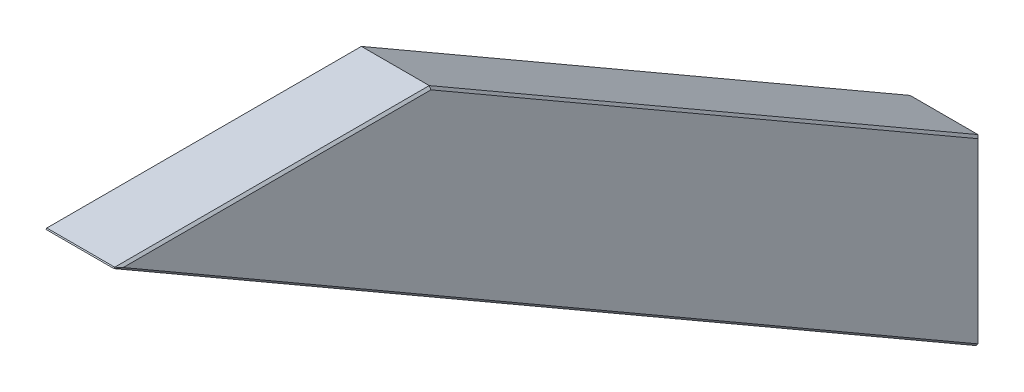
ISO-10303-21;
HEADER;
FILE_DESCRIPTION(('STEP AP214'),'2;1');
FILE_NAME('part.step','',(''),(''),'','','');
FILE_SCHEMA(('AUTOMOTIVE_DESIGN { 1 0 10303 214 1 1 1 1 }'));
ENDSEC;
DATA;
#1=APPLICATION_CONTEXT('core data for automotive mechanical design processes');
#2=APPLICATION_PROTOCOL_DEFINITION('international standard','automotive_design',2000,#1);
#3=PRODUCT_CONTEXT('',#1,'mechanical');
#4=PRODUCT('Part','Part','',(#3));
#5=PRODUCT_RELATED_PRODUCT_CATEGORY('part','',(#4));
#6=PRODUCT_DEFINITION_FORMATION('','',#4);
#7=PRODUCT_DEFINITION_CONTEXT('part definition',#1,'design');
#8=PRODUCT_DEFINITION('design','',#6,#7);
#9=PRODUCT_DEFINITION_SHAPE('','',#8);
#10=(LENGTH_UNIT() NAMED_UNIT(*) SI_UNIT(.MILLI.,.METRE.));
#11=(NAMED_UNIT(*) PLANE_ANGLE_UNIT() SI_UNIT($,.RADIAN.));
#12=(NAMED_UNIT(*) SI_UNIT($,.STERADIAN.) SOLID_ANGLE_UNIT());
#13=UNCERTAINTY_MEASURE_WITH_UNIT(LENGTH_MEASURE(1.E-05),#10,'distance_accuracy_value','');
#14=(GEOMETRIC_REPRESENTATION_CONTEXT(3) GLOBAL_UNCERTAINTY_ASSIGNED_CONTEXT((#13)) GLOBAL_UNIT_ASSIGNED_CONTEXT((#10,
#11,#12)) REPRESENTATION_CONTEXT('',''));
#15=CARTESIAN_POINT('',(0.,0.,0.));
#16=DIRECTION('',(0.,0.,1.));
#17=DIRECTION('',(1.,0.,0.));
#18=AXIS2_PLACEMENT_3D('',#15,#16,#17);
#19=CARTESIAN_POINT('',(8.,-69.9979466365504,-121.24));
#20=DIRECTION('',(0.,-0.866025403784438,0.500000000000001));
#21=DIRECTION('',(0.,-0.500000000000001,-0.866025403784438));
#22=AXIS2_PLACEMENT_3D('',#19,#20,#21);
#23=PLANE('',#22);
#24=DIRECTION('',(-1.,0.,0.));
#25=VECTOR('',#24,1.);
#26=CARTESIAN_POINT('',(8.,-69.9979466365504,-121.24));
#27=LINE('',#26,#25);
#28=CARTESIAN_POINT('',(7.5,-69.9979466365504,-121.24));
#29=VERTEX_POINT('',#28);
#30=CARTESIAN_POINT('',(-7.5,-69.9979466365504,-121.24));
#31=VERTEX_POINT('',#30);
#32=EDGE_CURVE('E146',#29,#31,#27,.T.);
#33=ORIENTED_EDGE('',*,*,#32,.T.);
#34=DIRECTION('',(0.,0.500000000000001,0.866025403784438));
#35=VECTOR('',#34,1.);
#36=CARTESIAN_POINT('',(-7.5,0.,0.));
#37=LINE('',#36,#35);
#38=CARTESIAN_POINT('',(-7.5,0.,0.));
#39=VERTEX_POINT('',#38);
#40=EDGE_CURVE('E175',#31,#39,#37,.T.);
#41=ORIENTED_EDGE('',*,*,#40,.T.);
#42=DIRECTION('',(-1.,0.,0.));
#43=VECTOR('',#42,1.);
#44=CARTESIAN_POINT('',(8.,0.,0.));
#45=LINE('',#44,#43);
#46=CARTESIAN_POINT('',(7.5,0.,0.));
#47=VERTEX_POINT('',#46);
#48=EDGE_CURVE('E143',#47,#39,#45,.T.);
#49=ORIENTED_EDGE('',*,*,#48,.F.);
#50=DIRECTION('',(0.,-0.500000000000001,-0.866025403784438));
#51=VECTOR('',#50,1.);
#52=CARTESIAN_POINT('',(7.5,-69.9979466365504,-121.24));
#53=LINE('',#52,#51);
#54=EDGE_CURVE('E173',#47,#29,#53,.T.);
#55=ORIENTED_EDGE('',*,*,#54,.T.);
#56=EDGE_LOOP('',(#33,#41,#49,#55));
#57=FACE_BOUND('',#56,.T.);
#58=ADVANCED_FACE('F31',(#57),#23,.F.);
#59=CARTESIAN_POINT('',(8.,0.,0.));
#60=DIRECTION('',(0.,-1.,0.));
#61=DIRECTION('',(0.,0.,-1.));
#62=AXIS2_PLACEMENT_3D('',#59,#60,#61);
#63=PLANE('',#62);
#64=ORIENTED_EDGE('',*,*,#48,.T.);
#65=DIRECTION('',(0.,0.,1.));
#66=VECTOR('',#65,1.);
#67=CARTESIAN_POINT('',(-7.5,0.,69.9999999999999));
#68=LINE('',#67,#66);
#69=CARTESIAN_POINT('',(-7.5,0.,69.5));
#70=VERTEX_POINT('',#69);
#71=EDGE_CURVE('E157',#39,#70,#68,.T.);
#72=ORIENTED_EDGE('',*,*,#71,.T.);
#73=DIRECTION('',(1.,0.,0.));
#74=VECTOR('',#73,1.);
#75=CARTESIAN_POINT('',(8.,0.,69.5));
#76=LINE('',#75,#74);
#77=CARTESIAN_POINT('',(7.5,0.,69.5));
#78=VERTEX_POINT('',#77);
#79=EDGE_CURVE('E154',#70,#78,#76,.T.);
#80=ORIENTED_EDGE('',*,*,#79,.T.);
#81=DIRECTION('',(0.,0.,-1.));
#82=VECTOR('',#81,1.);
#83=CARTESIAN_POINT('',(7.5,0.,0.));
#84=LINE('',#83,#82);
#85=EDGE_CURVE('E152',#78,#47,#84,.T.);
#86=ORIENTED_EDGE('',*,*,#85,.T.);
#87=EDGE_LOOP('',(#64,#72,#80,#86));
#88=FACE_BOUND('',#87,.T.);
#89=ADVANCED_FACE('F235',(#88),#63,.F.);
#90=CARTESIAN_POINT('',(8.,0.,69.9999999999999));
#91=DIRECTION('',(0.,0.866025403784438,-0.500000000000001));
#92=DIRECTION('',(0.,0.500000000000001,0.866025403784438));
#93=AXIS2_PLACEMENT_3D('',#90,#91,#92);
#94=PLANE('',#93);
#95=DIRECTION('',(-1.,0.,0.));
#96=VECTOR('',#95,1.);
#97=CARTESIAN_POINT('',(8.,-0.183012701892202,69.6830127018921));
#98=LINE('',#97,#96);
#99=CARTESIAN_POINT('',(7.49999999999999,-0.183012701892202,69.6830127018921));
#100=VERTEX_POINT('',#99);
#101=CARTESIAN_POINT('',(-7.49999999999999,-0.183012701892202,69.6830127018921));
#102=VERTEX_POINT('',#101);
#103=EDGE_CURVE('E118',#100,#102,#98,.T.);
#104=ORIENTED_EDGE('',*,*,#103,.T.);
#105=DIRECTION('',(0.,-0.500000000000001,-0.866025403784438));
#106=VECTOR('',#105,1.);
#107=CARTESIAN_POINT('',(-7.49999999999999,-110.412465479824,-121.24));
#108=LINE('',#107,#106);
#109=CARTESIAN_POINT('',(-7.49999999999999,-110.162465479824,-120.806987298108));
#110=VERTEX_POINT('',#109);
#111=EDGE_CURVE('E114',#102,#110,#108,.T.);
#112=ORIENTED_EDGE('',*,*,#111,.T.);
#113=DIRECTION('',(1.,0.,0.));
#114=VECTOR('',#113,1.);
#115=CARTESIAN_POINT('',(8.,-110.162465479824,-120.806987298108));
#116=LINE('',#115,#114);
#117=CARTESIAN_POINT('',(7.49999999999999,-110.162465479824,-120.806987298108));
#118=VERTEX_POINT('',#117);
#119=EDGE_CURVE('E106',#110,#118,#116,.T.);
#120=ORIENTED_EDGE('',*,*,#119,.T.);
#121=DIRECTION('',(0.,0.500000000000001,0.866025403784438));
#122=VECTOR('',#121,1.);
#123=CARTESIAN_POINT('',(7.49999999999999,0.,69.9999999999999));
#124=LINE('',#123,#122);
#125=EDGE_CURVE('E111',#118,#100,#124,.T.);
#126=ORIENTED_EDGE('',*,*,#125,.T.);
#127=EDGE_LOOP('',(#104,#112,#120,#126));
#128=FACE_BOUND('',#127,.T.);
#129=ADVANCED_FACE('F109',(#128),#94,.F.);
#130=CARTESIAN_POINT('',(8.,-110.412465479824,-121.24));
#131=DIRECTION('',(0.,0.,1.));
#132=DIRECTION('',(0.,-1.,0.));
#133=AXIS2_PLACEMENT_3D('',#130,#131,#132);
#134=PLANE('',#133);
#135=DIRECTION('',(-1.,0.,0.));
#136=VECTOR('',#135,1.);
#137=CARTESIAN_POINT('',(8.,-110.04644007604,-121.24));
#138=LINE('',#137,#136);
#139=CARTESIAN_POINT('',(7.5,-110.04644007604,-121.24));
#140=VERTEX_POINT('',#139);
#141=CARTESIAN_POINT('',(-7.5,-110.04644007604,-121.24));
#142=VERTEX_POINT('',#141);
#143=EDGE_CURVE('E125',#140,#142,#138,.T.);
#144=ORIENTED_EDGE('',*,*,#143,.T.);
#145=DIRECTION('',(0.,1.,0.));
#146=VECTOR('',#145,1.);
#147=CARTESIAN_POINT('',(-7.5,-69.9979466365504,-121.24));
#148=LINE('',#147,#146);
#149=EDGE_CURVE('E162',#142,#31,#148,.T.);
#150=ORIENTED_EDGE('',*,*,#149,.T.);
#151=ORIENTED_EDGE('',*,*,#32,.F.);
#152=DIRECTION('',(0.,-1.,0.));
#153=VECTOR('',#152,1.);
#154=CARTESIAN_POINT('',(7.5,-110.412465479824,-121.24));
#155=LINE('',#154,#153);
#156=EDGE_CURVE('E159',#29,#140,#155,.T.);
#157=ORIENTED_EDGE('',*,*,#156,.T.);
#158=EDGE_LOOP('',(#144,#150,#151,#157));
#159=FACE_BOUND('',#158,.T.);
#160=ADVANCED_FACE('F386',(#159),#134,.F.);
#161=CARTESIAN_POINT('',(8.,-69.9979466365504,-121.24));
#162=DIRECTION('',(-1.,0.,0.));
#163=DIRECTION('',(0.,0.,1.));
#164=AXIS2_PLACEMENT_3D('',#161,#162,#163);
#165=PLANE('',#164);
#166=DIRECTION('',(0.,-0.500000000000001,-0.866025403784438));
#167=VECTOR('',#166,1.);
#168=CARTESIAN_POINT('',(8.,-99.8758230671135,-103.99));
#169=LINE('',#168,#167);
#170=CARTESIAN_POINT('',(8.,-0.500000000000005,68.1339745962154));
#171=VERTEX_POINT('',#170);
#172=CARTESIAN_POINT('',(8.,-109.54644007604,-120.74));
#173=VERTEX_POINT('',#172);
#174=EDGE_CURVE('E40',#171,#173,#169,.T.);
#175=ORIENTED_EDGE('',*,*,#174,.T.);
#176=DIRECTION('',(0.,1.,0.));
#177=VECTOR('',#176,1.);
#178=CARTESIAN_POINT('',(8.,-69.9979466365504,-120.74));
#179=LINE('',#178,#177);
#180=CARTESIAN_POINT('',(8.,-70.2866217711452,-120.74));
#181=VERTEX_POINT('',#180);
#182=EDGE_CURVE('E11',#173,#181,#179,.T.);
#183=ORIENTED_EDGE('',*,*,#182,.T.);
#184=DIRECTION('',(0.,0.500000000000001,0.866025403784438));
#185=VECTOR('',#184,1.);
#186=CARTESIAN_POINT('',(8.,-70.4309593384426,-120.99));
#187=LINE('',#186,#185);
#188=CARTESIAN_POINT('',(8.,-0.499999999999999,0.133974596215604));
#189=VERTEX_POINT('',#188);
#190=EDGE_CURVE('E177',#181,#189,#187,.T.);
#191=ORIENTED_EDGE('',*,*,#190,.T.);
#192=DIRECTION('',(0.,0.,1.));
#193=VECTOR('',#192,1.);
#194=CARTESIAN_POINT('',(8.,-0.499999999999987,-121.24));
#195=LINE('',#194,#193);
#196=EDGE_CURVE('E51',#189,#171,#195,.T.);
#197=ORIENTED_EDGE('',*,*,#196,.T.);
#198=EDGE_LOOP('',(#175,#183,#191,#197));
#199=FACE_BOUND('',#198,.T.);
#200=ADVANCED_FACE('F377',(#199),#165,.F.);
#201=CARTESIAN_POINT('',(-8.,-69.9979466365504,-121.24));
#202=DIRECTION('',(-1.,0.,0.));
#203=DIRECTION('',(0.,0.,1.));
#204=AXIS2_PLACEMENT_3D('',#201,#202,#203);
#205=PLANE('',#204);
#206=DIRECTION('',(0.,0.500000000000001,0.866025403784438));
#207=VECTOR('',#206,1.);
#208=CARTESIAN_POINT('',(-8.,0.433012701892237,69.7499999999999));
#209=LINE('',#208,#207);
#210=CARTESIAN_POINT('',(-8.,-109.54644007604,-120.74));
#211=VERTEX_POINT('',#210);
#212=CARTESIAN_POINT('',(-8.,-0.500000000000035,68.1339745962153));
#213=VERTEX_POINT('',#212);
#214=EDGE_CURVE('E168',#211,#213,#209,.T.);
#215=ORIENTED_EDGE('',*,*,#214,.T.);
#216=DIRECTION('',(0.,0.,-1.));
#217=VECTOR('',#216,1.);
#218=CARTESIAN_POINT('',(-8.,-0.500000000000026,0.));
#219=LINE('',#218,#217);
#220=CARTESIAN_POINT('',(-8.,-0.500000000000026,0.133974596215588));
#221=VERTEX_POINT('',#220);
#222=EDGE_CURVE('E170',#213,#221,#219,.T.);
#223=ORIENTED_EDGE('',*,*,#222,.T.);
#224=DIRECTION('',(0.,-0.500000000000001,-0.866025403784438));
#225=VECTOR('',#224,1.);
#226=CARTESIAN_POINT('',(-8.,-70.4309593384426,-120.99));
#227=LINE('',#226,#225);
#228=CARTESIAN_POINT('',(-8.,-70.2866217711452,-120.74));
#229=VERTEX_POINT('',#228);
#230=EDGE_CURVE('E164',#221,#229,#227,.T.);
#231=ORIENTED_EDGE('',*,*,#230,.T.);
#232=DIRECTION('',(0.,-1.,0.));
#233=VECTOR('',#232,1.);
#234=CARTESIAN_POINT('',(-8.,-110.412465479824,-120.74));
#235=LINE('',#234,#233);
#236=EDGE_CURVE('E166',#229,#211,#235,.T.);
#237=ORIENTED_EDGE('',*,*,#236,.T.);
#238=EDGE_LOOP('',(#215,#223,#231,#237));
#239=FACE_BOUND('',#238,.T.);
#240=ADVANCED_FACE('F369',(#239),#205,.T.);
#241=CARTESIAN_POINT('',(8.,-69.9979466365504,-120.74));
#242=DIRECTION('',(-0.707106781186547,0.,0.707106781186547));
#243=DIRECTION('',(0.707106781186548,0.,0.707106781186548));
#244=AXIS2_PLACEMENT_3D('',#241,#242,#243);
#245=PLANE('',#244);
#246=DIRECTION('',(-0.577350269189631,-0.577350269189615,-0.577350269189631));
#247=VECTOR('',#246,1.);
#248=CARTESIAN_POINT('',(7.60566243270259,-109.940777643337,-121.134337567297));
#249=LINE('',#248,#247);
#250=EDGE_CURVE('E129',#140,#173,#249,.F.);
#251=ORIENTED_EDGE('',*,*,#250,.F.);
#252=ORIENTED_EDGE('',*,*,#156,.F.);
#253=DIRECTION('',(-0.654653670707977,0.377964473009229,-0.654653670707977));
#254=VECTOR('',#253,1.);
#255=CARTESIAN_POINT('',(7.92857142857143,-70.2453824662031,-120.811428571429));
#256=LINE('',#255,#254);
#257=EDGE_CURVE('E35',#181,#29,#256,.T.);
#258=ORIENTED_EDGE('',*,*,#257,.F.);
#259=ORIENTED_EDGE('',*,*,#182,.F.);
#260=EDGE_LOOP('',(#251,#252,#258,#259));
#261=FACE_BOUND('',#260,.T.);
#262=ADVANCED_FACE('F33',(#261),#245,.F.);
#263=CARTESIAN_POINT('',(8.,-110.04644007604,-121.24));
#264=DIRECTION('',(0.,0.965925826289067,0.258819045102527));
#265=DIRECTION('',(0.,-0.258819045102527,0.965925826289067));
#266=AXIS2_PLACEMENT_3D('',#263,#264,#265);
#267=PLANE('',#266);
#268=DIRECTION('',(0.,0.258819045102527,-0.965925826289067));
#269=VECTOR('',#268,1.);
#270=CARTESIAN_POINT('',(-7.5,-110.04644007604,-121.24));
#271=LINE('',#270,#269);
#272=EDGE_CURVE('E130',#142,#110,#271,.F.);
#273=ORIENTED_EDGE('',*,*,#272,.F.);
#274=ORIENTED_EDGE('',*,*,#143,.F.);
#275=DIRECTION('',(0.,-0.258819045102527,0.965925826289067));
#276=VECTOR('',#275,1.);
#277=CARTESIAN_POINT('',(7.5,-110.162465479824,-120.806987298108));
#278=LINE('',#277,#276);
#279=EDGE_CURVE('E122',#118,#140,#278,.F.);
#280=ORIENTED_EDGE('',*,*,#279,.F.);
#281=ORIENTED_EDGE('',*,*,#119,.F.);
#282=EDGE_LOOP('',(#273,#274,#280,#281));
#283=FACE_BOUND('',#282,.T.);
#284=ADVANCED_FACE('F124',(#283),#267,.F.);
#285=CARTESIAN_POINT('',(-7.5,-110.412465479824,-121.24));
#286=DIRECTION('',(-0.707106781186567,0.,-0.707106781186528));
#287=DIRECTION('',(-0.707106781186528,0.,0.707106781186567));
#288=AXIS2_PLACEMENT_3D('',#285,#286,#287);
#289=PLANE('',#288);
#290=DIRECTION('',(-0.654653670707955,-0.377964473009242,0.654653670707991));
#291=VECTOR('',#290,1.);
#292=CARTESIAN_POINT('',(-7.5,-69.9979466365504,-121.24));
#293=LINE('',#292,#291);
#294=EDGE_CURVE('E201',#31,#229,#293,.T.);
#295=ORIENTED_EDGE('',*,*,#294,.F.);
#296=ORIENTED_EDGE('',*,*,#149,.F.);
#297=DIRECTION('',(0.57735026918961,-0.577350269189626,-0.577350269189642));
#298=VECTOR('',#297,1.);
#299=CARTESIAN_POINT('',(-7.5,-110.04644007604,-121.24));
#300=LINE('',#299,#298);
#301=EDGE_CURVE('E204',#211,#142,#300,.T.);
#302=ORIENTED_EDGE('',*,*,#301,.F.);
#303=ORIENTED_EDGE('',*,*,#236,.F.);
#304=EDGE_LOOP('',(#295,#296,#302,#303));
#305=FACE_BOUND('',#304,.T.);
#306=ADVANCED_FACE('F222',(#305),#289,.T.);
#307=CARTESIAN_POINT('',(8.,-70.4309593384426,-120.99));
#308=DIRECTION('',(-0.707106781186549,-0.612372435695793,0.353553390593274));
#309=DIRECTION('',(0.654653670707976,-0.755928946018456,0.));
#310=AXIS2_PLACEMENT_3D('',#307,#308,#309);
#311=PLANE('',#310);
#312=ORIENTED_EDGE('',*,*,#257,.T.);
#313=ORIENTED_EDGE('',*,*,#54,.F.);
#314=DIRECTION('',(0.694746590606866,-0.694746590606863,0.186156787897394));
#315=VECTOR('',#314,1.);
#316=CARTESIAN_POINT('',(26.0885928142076,-18.5885928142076,4.98079843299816));
#317=LINE('',#316,#315);
#318=EDGE_CURVE('E136',#189,#47,#317,.F.);
#319=ORIENTED_EDGE('',*,*,#318,.F.);
#320=ORIENTED_EDGE('',*,*,#190,.F.);
#321=EDGE_LOOP('',(#312,#313,#319,#320));
#322=FACE_BOUND('',#321,.T.);
#323=ADVANCED_FACE('F238',(#322),#311,.F.);
#324=CARTESIAN_POINT('',(7.49999999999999,-110.162465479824,-120.806987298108));
#325=DIRECTION('',(0.774596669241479,-0.610905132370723,-0.163691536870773));
#326=DIRECTION('',(0.619257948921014,0.785187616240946,0.));
#327=AXIS2_PLACEMENT_3D('',#324,#325,#326);
#328=PLANE('',#327);
#329=ORIENTED_EDGE('',*,*,#279,.T.);
#330=ORIENTED_EDGE('',*,*,#250,.T.);
#331=DIRECTION('',(0.62796303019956,0.773682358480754,0.0841310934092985));
#332=VECTOR('',#331,1.);
#333=CARTESIAN_POINT('',(7.49999999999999,-110.162465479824,-120.806987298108));
#334=LINE('',#333,#332);
#335=EDGE_CURVE('E133',#118,#173,#334,.T.);
#336=ORIENTED_EDGE('',*,*,#335,.F.);
#337=EDGE_LOOP('',(#329,#330,#336));
#338=FACE_BOUND('',#337,.T.);
#339=ADVANCED_FACE('F134',(#338),#328,.T.);
#340=CARTESIAN_POINT('',(-7.5,-110.04644007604,-121.24));
#341=DIRECTION('',(-0.774596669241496,-0.610905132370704,-0.163691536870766));
#342=DIRECTION('',(0.619257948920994,-0.785187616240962,0.));
#343=AXIS2_PLACEMENT_3D('',#340,#341,#342);
#344=PLANE('',#343);
#345=ORIENTED_EDGE('',*,*,#301,.T.);
#346=ORIENTED_EDGE('',*,*,#272,.T.);
#347=DIRECTION('',(-0.627963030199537,0.773682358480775,0.0841310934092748));
#348=VECTOR('',#347,1.);
#349=CARTESIAN_POINT('',(-7.5334936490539,-110.121199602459,-120.8025));
#350=LINE('',#349,#348);
#351=EDGE_CURVE('E137',#211,#110,#350,.F.);
#352=ORIENTED_EDGE('',*,*,#351,.F.);
#353=EDGE_LOOP('',(#345,#346,#352));
#354=FACE_BOUND('',#353,.T.);
#355=ADVANCED_FACE('F256',(#354),#344,.T.);
#356=CARTESIAN_POINT('',(-7.5,-69.9979466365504,-121.24));
#357=DIRECTION('',(-0.707106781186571,0.612372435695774,-0.353553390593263));
#358=DIRECTION('',(-0.654653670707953,-0.755928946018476,0.));
#359=AXIS2_PLACEMENT_3D('',#356,#357,#358);
#360=PLANE('',#359);
#361=ORIENTED_EDGE('',*,*,#294,.T.);
#362=ORIENTED_EDGE('',*,*,#230,.F.);
#363=DIRECTION('',(0.694746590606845,0.694746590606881,-0.186156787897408));
#364=VECTOR('',#363,1.);
#365=CARTESIAN_POINT('',(-25.6059199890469,-18.1059199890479,4.85146663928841));
#366=LINE('',#365,#364);
#367=EDGE_CURVE('E195',#39,#221,#366,.F.);
#368=ORIENTED_EDGE('',*,*,#367,.F.);
#369=ORIENTED_EDGE('',*,*,#40,.F.);
#370=EDGE_LOOP('',(#361,#362,#368,#369));
#371=FACE_BOUND('',#370,.T.);
#372=ADVANCED_FACE('F227',(#371),#360,.T.);
#373=CARTESIAN_POINT('',(8.,-0.499999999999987,-121.24));
#374=DIRECTION('',(-0.707106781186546,-0.707106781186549,0.));
#375=DIRECTION('',(0.707106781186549,-0.707106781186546,0.));
#376=AXIS2_PLACEMENT_3D('',#373,#374,#375);
#377=PLANE('',#376);
#378=ORIENTED_EDGE('',*,*,#318,.T.);
#379=ORIENTED_EDGE('',*,*,#85,.F.);
#380=DIRECTION('',(0.325057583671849,-0.325057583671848,-0.888073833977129));
#381=VECTOR('',#380,1.);
#382=CARTESIAN_POINT('',(7.5,0.,69.5));
#383=LINE('',#382,#381);
#384=EDGE_CURVE('E192',#171,#78,#383,.F.);
#385=ORIENTED_EDGE('',*,*,#384,.F.);
#386=ORIENTED_EDGE('',*,*,#196,.F.);
#387=EDGE_LOOP('',(#378,#379,#385,#386));
#388=FACE_BOUND('',#387,.T.);
#389=ADVANCED_FACE('F240',(#388),#377,.F.);
#390=CARTESIAN_POINT('',(8.,-99.8758230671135,-103.99));
#391=DIRECTION('',(-0.707106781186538,0.612372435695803,-0.353553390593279));
#392=DIRECTION('',(-0.654653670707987,-0.755928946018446,0.));
#393=AXIS2_PLACEMENT_3D('',#390,#391,#392);
#394=PLANE('',#393);
#395=ORIENTED_EDGE('',*,*,#335,.T.);
#396=ORIENTED_EDGE('',*,*,#174,.F.);
#397=DIRECTION('',(-0.301511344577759,0.191150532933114,0.934105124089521));
#398=VECTOR('',#397,1.);
#399=CARTESIAN_POINT('',(7.54099653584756,-0.209003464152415,69.5560023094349));
#400=LINE('',#399,#398);
#401=EDGE_CURVE('E141',#100,#171,#400,.F.);
#402=ORIENTED_EDGE('',*,*,#401,.F.);
#403=ORIENTED_EDGE('',*,*,#125,.F.);
#404=EDGE_LOOP('',(#395,#396,#402,#403));
#405=FACE_BOUND('',#404,.T.);
#406=ADVANCED_FACE('F139',(#405),#394,.F.);
#407=CARTESIAN_POINT('',(-7.5,0.,69.9999999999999));
#408=DIRECTION('',(-0.707106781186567,-0.612372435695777,0.353553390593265));
#409=DIRECTION('',(0.654653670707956,-0.755928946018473,0.));
#410=AXIS2_PLACEMENT_3D('',#407,#408,#409);
#411=PLANE('',#410);
#412=ORIENTED_EDGE('',*,*,#351,.T.);
#413=ORIENTED_EDGE('',*,*,#111,.F.);
#414=DIRECTION('',(0.30151134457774,0.191150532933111,0.934105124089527));
#415=VECTOR('',#414,1.);
#416=CARTESIAN_POINT('',(-7.49999999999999,-0.183012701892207,69.6830127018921));
#417=LINE('',#416,#415);
#418=EDGE_CURVE('E188',#213,#102,#417,.T.);
#419=ORIENTED_EDGE('',*,*,#418,.F.);
#420=ORIENTED_EDGE('',*,*,#214,.F.);
#421=EDGE_LOOP('',(#412,#413,#419,#420));
#422=FACE_BOUND('',#421,.T.);
#423=ADVANCED_FACE('F253',(#422),#411,.T.);
#424=CARTESIAN_POINT('',(-7.5,0.,0.));
#425=DIRECTION('',(-0.707106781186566,0.707106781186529,0.));
#426=DIRECTION('',(-0.707106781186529,-0.707106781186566,0.));
#427=AXIS2_PLACEMENT_3D('',#424,#425,#426);
#428=PLANE('',#427);
#429=ORIENTED_EDGE('',*,*,#367,.T.);
#430=ORIENTED_EDGE('',*,*,#222,.F.);
#431=DIRECTION('',(-0.325057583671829,-0.325057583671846,-0.888073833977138));
#432=VECTOR('',#431,1.);
#433=CARTESIAN_POINT('',(-7.46650635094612,0.0334936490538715,69.591506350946));
#434=LINE('',#433,#432);
#435=EDGE_CURVE('E185',#70,#213,#434,.T.);
#436=ORIENTED_EDGE('',*,*,#435,.F.);
#437=ORIENTED_EDGE('',*,*,#71,.F.);
#438=EDGE_LOOP('',(#429,#430,#436,#437));
#439=FACE_BOUND('',#438,.T.);
#440=ADVANCED_FACE('F232',(#439),#428,.T.);
#441=CARTESIAN_POINT('',(7.5,0.,69.5));
#442=DIRECTION('',(0.935113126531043,0.250562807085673,0.25056280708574));
#443=DIRECTION('',(0.258819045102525,0.,-0.965925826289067));
#444=AXIS2_PLACEMENT_3D('',#441,#442,#443);
#445=PLANE('',#444);
#446=ORIENTED_EDGE('',*,*,#401,.T.);
#447=ORIENTED_EDGE('',*,*,#384,.T.);
#448=DIRECTION('',(0.,0.707106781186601,-0.707106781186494));
#449=VECTOR('',#448,1.);
#450=CARTESIAN_POINT('',(7.5,0.,69.5));
#451=LINE('',#450,#449);
#452=EDGE_CURVE('E183',#100,#78,#451,.T.);
#453=ORIENTED_EDGE('',*,*,#452,.F.);
#454=EDGE_LOOP('',(#446,#447,#453));
#455=FACE_BOUND('',#454,.T.);
#456=ADVANCED_FACE('F243',(#455),#445,.T.);
#457=CARTESIAN_POINT('',(-7.49999999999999,-0.183012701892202,69.6830127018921));
#458=DIRECTION('',(-0.935113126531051,0.250562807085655,0.250562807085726));
#459=DIRECTION('',(0.25881904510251,0.,0.965925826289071));
#460=AXIS2_PLACEMENT_3D('',#457,#458,#459);
#461=PLANE('',#460);
#462=ORIENTED_EDGE('',*,*,#435,.T.);
#463=ORIENTED_EDGE('',*,*,#418,.T.);
#464=DIRECTION('',(0.,-0.707106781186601,0.707106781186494));
#465=VECTOR('',#464,1.);
#466=CARTESIAN_POINT('',(-7.49999999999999,-0.183012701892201,69.6830127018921));
#467=LINE('',#466,#465);
#468=EDGE_CURVE('E181',#70,#102,#467,.T.);
#469=ORIENTED_EDGE('',*,*,#468,.F.);
#470=EDGE_LOOP('',(#462,#463,#469));
#471=FACE_BOUND('',#470,.T.);
#472=ADVANCED_FACE('F250',(#471),#461,.T.);
#473=CARTESIAN_POINT('',(8.,-0.1830127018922,69.6830127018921));
#474=DIRECTION('',(0.,-0.707106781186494,-0.707106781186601));
#475=DIRECTION('',(0.,0.707106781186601,-0.707106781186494));
#476=AXIS2_PLACEMENT_3D('',#473,#474,#475);
#477=PLANE('',#476);
#478=ORIENTED_EDGE('',*,*,#452,.T.);
#479=ORIENTED_EDGE('',*,*,#79,.F.);
#480=ORIENTED_EDGE('',*,*,#468,.T.);
#481=ORIENTED_EDGE('',*,*,#103,.F.);
#482=EDGE_LOOP('',(#478,#479,#480,#481));
#483=FACE_BOUND('',#482,.T.);
#484=ADVANCED_FACE('F246',(#483),#477,.F.);
#485=CLOSED_SHELL('',(#58,#89,#129,#160,#200,#240,#262,#284,#306,#323,#339,#355,#372,#389,#406,
#423,#440,#456,#472,#484));
#486=MANIFOLD_SOLID_BREP('B2',#485);
#487=ADVANCED_BREP_SHAPE_REPRESENTATION('',(#18,#486),#14);
#488=SHAPE_DEFINITION_REPRESENTATION(#9,#487);
ENDSEC;
END-ISO-10303-21;
